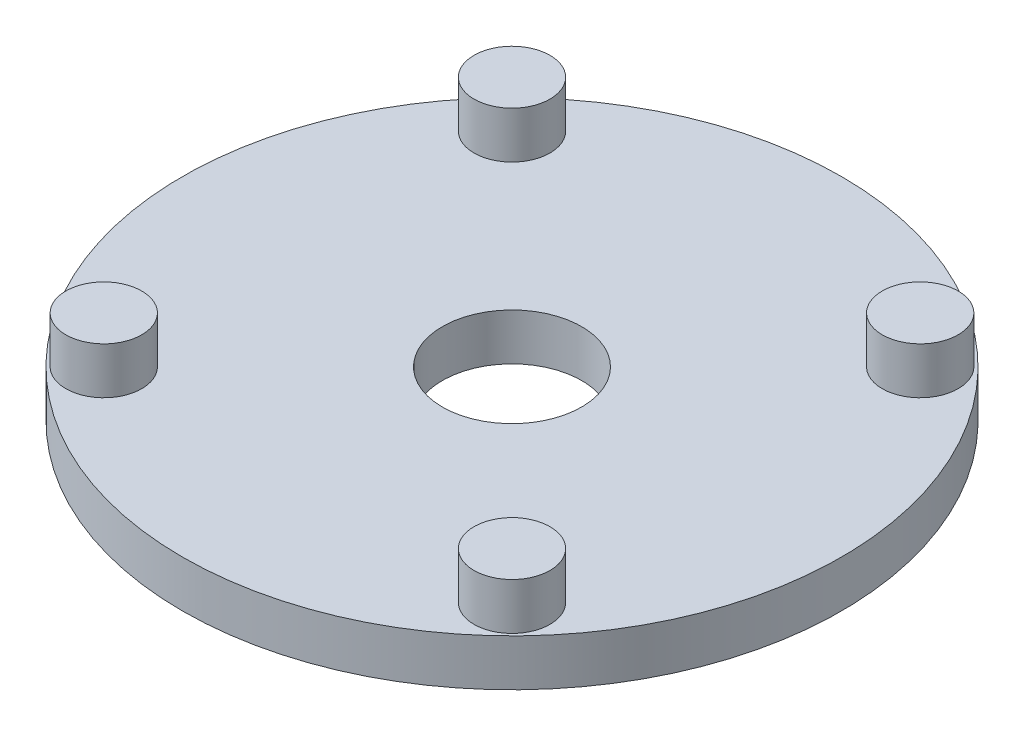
from build123d import *

# Parameters (mm, degrees)
SKETCH1_R           = 29
SKETCH1_R_2         = 6.13
BOSS_EXTRUDE1_DEPTH = 2.055
SKETCH2_R           = 3.34
BOSS_EXTRUDE2_DEPTH = 4.11


with BuildPart() as part:
    # Sketch1 → Boss-Extrude1 (new, symmetric)
    with BuildSketch(Plane(origin=(0, 0, 0), x_dir=(1, 0, 0), z_dir=(0, 1, 0))):
        with Locations(Location((0, 0, 0), (0, 0, 270))):
            Circle(SKETCH1_R)
        with Locations(Location((0, 0, 0), (0, 0, 270))):
            Circle(SKETCH1_R_2, mode=Mode.SUBTRACT)
    extrude(amount=BOSS_EXTRUDE1_DEPTH, both=True)

    # Sketch2 → Boss-Extrude2 (add)
    with BuildSketch(Plane(origin=(0, 2.055, 0), x_dir=(1, 0, 0), z_dir=(0, 1, 0))):
        with Locations(Location((-17.960512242, 17.960512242, 0), (0, 0, 270))):
            Circle(SKETCH2_R)
        with Locations(Location((-17.960512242, -17.960512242, 0), (0, 0, 270))):
            Circle(SKETCH2_R)
        with Locations(Location((17.960512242, -17.960512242, 0), (0, 0, 270))):
            Circle(SKETCH2_R)
        with Locations(Location((17.960512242, 17.960512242, 0), (0, 0, 270))):
            Circle(SKETCH2_R)
    extrude(amount=BOSS_EXTRUDE2_DEPTH)


solid = part.part
